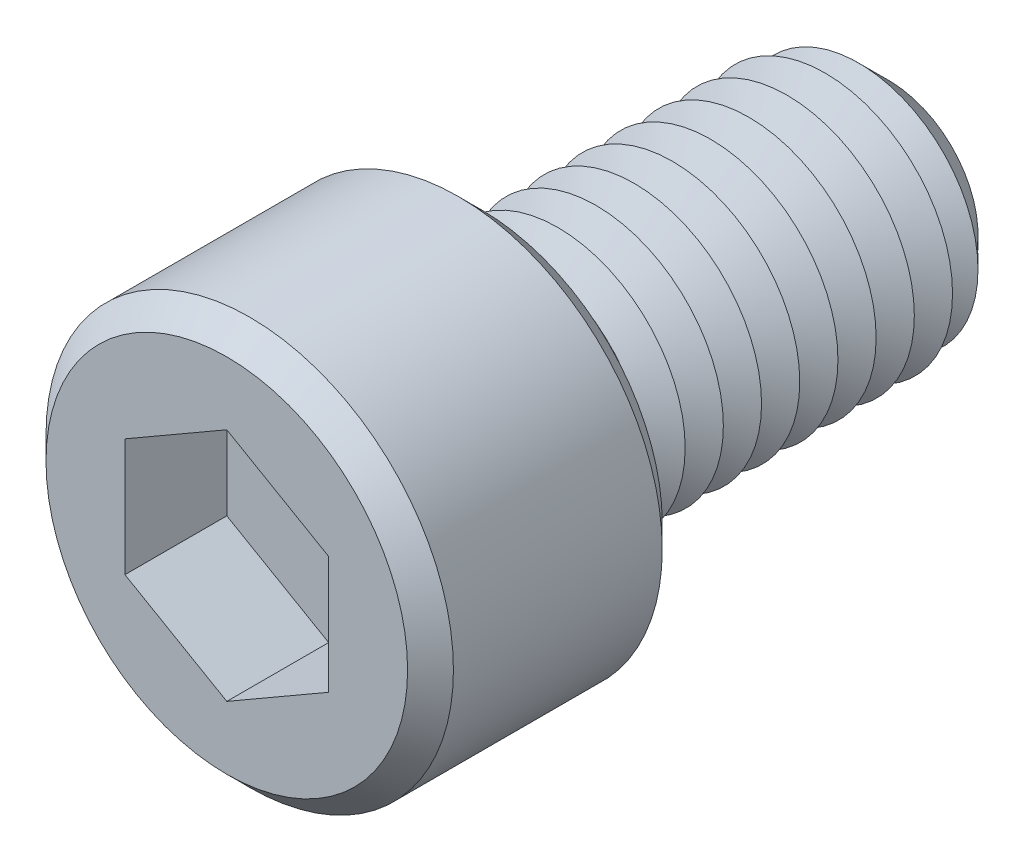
ISO-10303-21;
HEADER;
FILE_DESCRIPTION(('STEP AP214'),'2;1');
FILE_NAME('part.step','',(''),(''),'','','');
FILE_SCHEMA(('AUTOMOTIVE_DESIGN { 1 0 10303 214 1 1 1 1 }'));
ENDSEC;
DATA;
#1=APPLICATION_CONTEXT('core data for automotive mechanical design processes');
#2=APPLICATION_PROTOCOL_DEFINITION('international standard','automotive_design',2000,#1);
#3=PRODUCT_CONTEXT('',#1,'mechanical');
#4=PRODUCT('Part','Part','',(#3));
#5=PRODUCT_RELATED_PRODUCT_CATEGORY('part','',(#4));
#6=PRODUCT_DEFINITION_FORMATION('','',#4);
#7=PRODUCT_DEFINITION_CONTEXT('part definition',#1,'design');
#8=PRODUCT_DEFINITION('design','',#6,#7);
#9=PRODUCT_DEFINITION_SHAPE('','',#8);
#10=(LENGTH_UNIT() NAMED_UNIT(*) SI_UNIT(.MILLI.,.METRE.));
#11=(NAMED_UNIT(*) PLANE_ANGLE_UNIT() SI_UNIT($,.RADIAN.));
#12=(NAMED_UNIT(*) SI_UNIT($,.STERADIAN.) SOLID_ANGLE_UNIT());
#13=UNCERTAINTY_MEASURE_WITH_UNIT(LENGTH_MEASURE(1.E-05),#10,'distance_accuracy_value','');
#14=(GEOMETRIC_REPRESENTATION_CONTEXT(3) GLOBAL_UNCERTAINTY_ASSIGNED_CONTEXT((#13)) GLOBAL_UNIT_ASSIGNED_CONTEXT((#10,
#11,#12)) REPRESENTATION_CONTEXT('',''));
#15=CARTESIAN_POINT('',(0.,0.,0.));
#16=DIRECTION('',(0.,0.,1.));
#17=DIRECTION('',(1.,0.,0.));
#18=AXIS2_PLACEMENT_3D('',#15,#16,#17);
#19=CARTESIAN_POINT('',(0.,0.,10.));
#20=DIRECTION('',(0.,0.,-1.));
#21=DIRECTION('',(-1.,0.,0.));
#22=AXIS2_PLACEMENT_3D('',#19,#20,#21);
#23=CYLINDRICAL_SURFACE('',#22,8.);
#24=CARTESIAN_POINT('',(0.,0.,0.899999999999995));
#25=DIRECTION('',(0.,0.,1.));
#26=DIRECTION('',(1.,0.,0.));
#27=AXIS2_PLACEMENT_3D('',#24,#25,#26);
#28=CIRCLE('',#27,8.);
#29=CARTESIAN_POINT('',(8.,0.,0.899999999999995));
#30=VERTEX_POINT('',#29);
#31=EDGE_CURVE('E257',#30,#30,#28,.T.);
#32=ORIENTED_EDGE('',*,*,#31,.T.);
#33=EDGE_LOOP('',(#32));
#34=FACE_BOUND('',#33,.T.);
#35=CARTESIAN_POINT('',(0.,0.,9.1));
#36=DIRECTION('',(0.,0.,1.));
#37=DIRECTION('',(1.,0.,0.));
#38=AXIS2_PLACEMENT_3D('',#35,#36,#37);
#39=CIRCLE('',#38,8.);
#40=CARTESIAN_POINT('',(8.,0.,9.1));
#41=VERTEX_POINT('',#40);
#42=EDGE_CURVE('E250',#41,#41,#39,.F.);
#43=ORIENTED_EDGE('',*,*,#42,.T.);
#44=EDGE_LOOP('',(#43));
#45=FACE_BOUND('',#44,.T.);
#46=ADVANCED_FACE('F39',(#34,#45),#23,.T.);
#47=CARTESIAN_POINT('',(0.,0.,10.));
#48=DIRECTION('',(0.,0.,1.));
#49=DIRECTION('',(1.,0.,0.));
#50=AXIS2_PLACEMENT_3D('',#47,#48,#49);
#51=PLANE('',#50);
#52=CARTESIAN_POINT('',(0.,0.,10.));
#53=DIRECTION('',(0.,0.,1.));
#54=DIRECTION('',(1.,0.,0.));
#55=AXIS2_PLACEMENT_3D('',#52,#53,#54);
#56=CIRCLE('',#55,7.1);
#57=CARTESIAN_POINT('',(7.1,0.,10.));
#58=VERTEX_POINT('',#57);
#59=EDGE_CURVE('E11',#58,#58,#56,.T.);
#60=ORIENTED_EDGE('',*,*,#59,.T.);
#61=EDGE_LOOP('',(#60));
#62=FACE_BOUND('',#61,.T.);
#63=DIRECTION('',(-0.866025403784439,0.5,0.));
#64=VECTOR('',#63,1.);
#65=CARTESIAN_POINT('',(4.,2.3094010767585,10.));
#66=LINE('',#65,#64);
#67=CARTESIAN_POINT('',(4.,2.3094010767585,10.));
#68=VERTEX_POINT('',#67);
#69=CARTESIAN_POINT('',(0.,4.61880215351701,10.));
#70=VERTEX_POINT('',#69);
#71=EDGE_CURVE('E55',#68,#70,#66,.T.);
#72=ORIENTED_EDGE('',*,*,#71,.F.);
#73=DIRECTION('',(0.,1.,0.));
#74=VECTOR('',#73,1.);
#75=CARTESIAN_POINT('',(4.,-2.3094010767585,10.));
#76=LINE('',#75,#74);
#77=CARTESIAN_POINT('',(4.,-2.3094010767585,10.));
#78=VERTEX_POINT('',#77);
#79=EDGE_CURVE('E151',#78,#68,#76,.T.);
#80=ORIENTED_EDGE('',*,*,#79,.F.);
#81=DIRECTION('',(0.866025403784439,0.5,0.));
#82=VECTOR('',#81,1.);
#83=CARTESIAN_POINT('',(0.,-4.618802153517,10.));
#84=LINE('',#83,#82);
#85=CARTESIAN_POINT('',(0.,-4.618802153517,10.));
#86=VERTEX_POINT('',#85);
#87=EDGE_CURVE('E148',#86,#78,#84,.T.);
#88=ORIENTED_EDGE('',*,*,#87,.F.);
#89=DIRECTION('',(0.866025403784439,-0.5,0.));
#90=VECTOR('',#89,1.);
#91=CARTESIAN_POINT('',(-4.,-2.3094010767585,10.));
#92=LINE('',#91,#90);
#93=CARTESIAN_POINT('',(-4.,-2.3094010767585,10.));
#94=VERTEX_POINT('',#93);
#95=EDGE_CURVE('E103',#94,#86,#92,.T.);
#96=ORIENTED_EDGE('',*,*,#95,.F.);
#97=DIRECTION('',(0.,-1.,0.));
#98=VECTOR('',#97,1.);
#99=CARTESIAN_POINT('',(-4.,2.3094010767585,10.));
#100=LINE('',#99,#98);
#101=CARTESIAN_POINT('',(-4.,2.3094010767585,10.));
#102=VERTEX_POINT('',#101);
#103=EDGE_CURVE('E142',#102,#94,#100,.T.);
#104=ORIENTED_EDGE('',*,*,#103,.F.);
#105=DIRECTION('',(-0.866025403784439,-0.5,0.));
#106=VECTOR('',#105,1.);
#107=CARTESIAN_POINT('',(0.,4.61880215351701,10.));
#108=LINE('',#107,#106);
#109=EDGE_CURVE('E137',#70,#102,#108,.T.);
#110=ORIENTED_EDGE('',*,*,#109,.F.);
#111=EDGE_LOOP('',(#72,#80,#88,#96,#104,#110));
#112=FACE_BOUND('',#111,.T.);
#113=ADVANCED_FACE('F275',(#62,#112),#51,.T.);
#114=CARTESIAN_POINT('',(0.,0.,0.));
#115=DIRECTION('',(0.,0.,1.));
#116=DIRECTION('',(1.,0.,0.));
#117=AXIS2_PLACEMENT_3D('',#114,#115,#116);
#118=PLANE('',#117);
#119=CARTESIAN_POINT('',(0.,0.,0.));
#120=DIRECTION('',(0.,0.,1.));
#121=DIRECTION('',(1.,0.,0.));
#122=AXIS2_PLACEMENT_3D('',#119,#120,#121);
#123=CIRCLE('',#122,7.1);
#124=CARTESIAN_POINT('',(7.1,0.,0.));
#125=VERTEX_POINT('',#124);
#126=EDGE_CURVE('E48',#125,#125,#123,.F.);
#127=ORIENTED_EDGE('',*,*,#126,.T.);
#128=EDGE_LOOP('',(#127));
#129=FACE_BOUND('',#128,.T.);
#130=CARTESIAN_POINT('',(0.,0.,0.));
#131=DIRECTION('',(0.,0.,1.));
#132=DIRECTION('',(1.,0.,0.));
#133=AXIS2_PLACEMENT_3D('',#130,#131,#132);
#134=CIRCLE('',#133,5.);
#135=CARTESIAN_POINT('',(5.,0.,0.));
#136=VERTEX_POINT('',#135);
#137=EDGE_CURVE('E243',#136,#136,#134,.T.);
#138=ORIENTED_EDGE('',*,*,#137,.T.);
#139=EDGE_LOOP('',(#138));
#140=FACE_BOUND('',#139,.T.);
#141=ADVANCED_FACE('F264',(#129,#140),#118,.F.);
#142=CARTESIAN_POINT('',(0.,0.,0.));
#143=DIRECTION('',(0.,0.,1.));
#144=DIRECTION('',(1.,0.,0.));
#145=AXIS2_PLACEMENT_3D('',#142,#143,#144);
#146=CONICAL_SURFACE('',#145,5.,1.0471975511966);
#147=CARTESIAN_POINT('',(0.,0.,-0.749999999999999));
#148=DIRECTION('',(0.,0.,1.));
#149=DIRECTION('',(1.,0.,0.));
#150=AXIS2_PLACEMENT_3D('',#147,#148,#149);
#151=CIRCLE('',#150,3.70096189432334);
#152=CARTESIAN_POINT('',(3.70096189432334,0.,-0.749999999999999));
#153=VERTEX_POINT('',#152);
#154=EDGE_CURVE('E239',#153,#153,#151,.T.);
#155=ORIENTED_EDGE('',*,*,#154,.T.);
#156=EDGE_LOOP('',(#155));
#157=FACE_BOUND('',#156,.T.);
#158=ORIENTED_EDGE('',*,*,#137,.F.);
#159=EDGE_LOOP('',(#158));
#160=FACE_BOUND('',#159,.T.);
#161=ADVANCED_FACE('F404',(#157,#160),#146,.T.);
#162=CARTESIAN_POINT('',(0.,0.,-0.749999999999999));
#163=DIRECTION('',(0.,0.,-1.));
#164=DIRECTION('',(-1.,0.,0.));
#165=AXIS2_PLACEMENT_3D('',#162,#163,#164);
#166=CONICAL_SURFACE('',#165,3.70096189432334,1.0471975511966);
#167=CARTESIAN_POINT('',(0.,0.,-1.5));
#168=DIRECTION('',(0.,0.,1.));
#169=DIRECTION('',(1.,0.,0.));
#170=AXIS2_PLACEMENT_3D('',#167,#168,#169);
#171=CIRCLE('',#170,5.);
#172=CARTESIAN_POINT('',(5.,0.,-1.5));
#173=VERTEX_POINT('',#172);
#174=EDGE_CURVE('E235',#173,#173,#171,.T.);
#175=ORIENTED_EDGE('',*,*,#174,.T.);
#176=EDGE_LOOP('',(#175));
#177=FACE_BOUND('',#176,.T.);
#178=ORIENTED_EDGE('',*,*,#154,.F.);
#179=EDGE_LOOP('',(#178));
#180=FACE_BOUND('',#179,.T.);
#181=ADVANCED_FACE('F400',(#177,#180),#166,.T.);
#182=CARTESIAN_POINT('',(0.,0.,-1.5));
#183=DIRECTION('',(0.,0.,1.));
#184=DIRECTION('',(1.,0.,0.));
#185=AXIS2_PLACEMENT_3D('',#182,#183,#184);
#186=CONICAL_SURFACE('',#185,5.,1.0471975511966);
#187=CARTESIAN_POINT('',(0.,0.,-2.25));
#188=DIRECTION('',(0.,0.,1.));
#189=DIRECTION('',(1.,0.,0.));
#190=AXIS2_PLACEMENT_3D('',#187,#188,#189);
#191=CIRCLE('',#190,3.70096189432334);
#192=CARTESIAN_POINT('',(3.70096189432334,0.,-2.25));
#193=VERTEX_POINT('',#192);
#194=EDGE_CURVE('E231',#193,#193,#191,.T.);
#195=ORIENTED_EDGE('',*,*,#194,.T.);
#196=EDGE_LOOP('',(#195));
#197=FACE_BOUND('',#196,.T.);
#198=ORIENTED_EDGE('',*,*,#174,.F.);
#199=EDGE_LOOP('',(#198));
#200=FACE_BOUND('',#199,.T.);
#201=ADVANCED_FACE('F396',(#197,#200),#186,.T.);
#202=CARTESIAN_POINT('',(0.,0.,-2.25));
#203=DIRECTION('',(0.,0.,-1.));
#204=DIRECTION('',(-1.,0.,0.));
#205=AXIS2_PLACEMENT_3D('',#202,#203,#204);
#206=CONICAL_SURFACE('',#205,3.70096189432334,1.0471975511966);
#207=CARTESIAN_POINT('',(0.,0.,-3.));
#208=DIRECTION('',(0.,0.,1.));
#209=DIRECTION('',(1.,0.,0.));
#210=AXIS2_PLACEMENT_3D('',#207,#208,#209);
#211=CIRCLE('',#210,5.);
#212=CARTESIAN_POINT('',(5.,0.,-3.));
#213=VERTEX_POINT('',#212);
#214=EDGE_CURVE('E227',#213,#213,#211,.T.);
#215=ORIENTED_EDGE('',*,*,#214,.T.);
#216=EDGE_LOOP('',(#215));
#217=FACE_BOUND('',#216,.T.);
#218=ORIENTED_EDGE('',*,*,#194,.F.);
#219=EDGE_LOOP('',(#218));
#220=FACE_BOUND('',#219,.T.);
#221=ADVANCED_FACE('F392',(#217,#220),#206,.T.);
#222=CARTESIAN_POINT('',(0.,0.,-3.));
#223=DIRECTION('',(0.,0.,1.));
#224=DIRECTION('',(1.,0.,0.));
#225=AXIS2_PLACEMENT_3D('',#222,#223,#224);
#226=CONICAL_SURFACE('',#225,5.,1.0471975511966);
#227=CARTESIAN_POINT('',(0.,0.,-3.75));
#228=DIRECTION('',(0.,0.,1.));
#229=DIRECTION('',(1.,0.,0.));
#230=AXIS2_PLACEMENT_3D('',#227,#228,#229);
#231=CIRCLE('',#230,3.70096189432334);
#232=CARTESIAN_POINT('',(3.70096189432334,0.,-3.75));
#233=VERTEX_POINT('',#232);
#234=EDGE_CURVE('E223',#233,#233,#231,.T.);
#235=ORIENTED_EDGE('',*,*,#234,.T.);
#236=EDGE_LOOP('',(#235));
#237=FACE_BOUND('',#236,.T.);
#238=ORIENTED_EDGE('',*,*,#214,.F.);
#239=EDGE_LOOP('',(#238));
#240=FACE_BOUND('',#239,.T.);
#241=ADVANCED_FACE('F388',(#237,#240),#226,.T.);
#242=CARTESIAN_POINT('',(0.,0.,-3.75));
#243=DIRECTION('',(0.,0.,-1.));
#244=DIRECTION('',(-1.,0.,0.));
#245=AXIS2_PLACEMENT_3D('',#242,#243,#244);
#246=CONICAL_SURFACE('',#245,3.70096189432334,1.0471975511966);
#247=CARTESIAN_POINT('',(0.,0.,-4.5));
#248=DIRECTION('',(0.,0.,1.));
#249=DIRECTION('',(1.,0.,0.));
#250=AXIS2_PLACEMENT_3D('',#247,#248,#249);
#251=CIRCLE('',#250,5.);
#252=CARTESIAN_POINT('',(5.,0.,-4.5));
#253=VERTEX_POINT('',#252);
#254=EDGE_CURVE('E219',#253,#253,#251,.T.);
#255=ORIENTED_EDGE('',*,*,#254,.T.);
#256=EDGE_LOOP('',(#255));
#257=FACE_BOUND('',#256,.T.);
#258=ORIENTED_EDGE('',*,*,#234,.F.);
#259=EDGE_LOOP('',(#258));
#260=FACE_BOUND('',#259,.T.);
#261=ADVANCED_FACE('F384',(#257,#260),#246,.T.);
#262=CARTESIAN_POINT('',(0.,0.,-4.5));
#263=DIRECTION('',(0.,0.,1.));
#264=DIRECTION('',(1.,0.,0.));
#265=AXIS2_PLACEMENT_3D('',#262,#263,#264);
#266=CONICAL_SURFACE('',#265,5.,1.0471975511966);
#267=CARTESIAN_POINT('',(0.,0.,-5.25));
#268=DIRECTION('',(0.,0.,1.));
#269=DIRECTION('',(1.,0.,0.));
#270=AXIS2_PLACEMENT_3D('',#267,#268,#269);
#271=CIRCLE('',#270,3.70096189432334);
#272=CARTESIAN_POINT('',(3.70096189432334,0.,-5.25));
#273=VERTEX_POINT('',#272);
#274=EDGE_CURVE('E215',#273,#273,#271,.T.);
#275=ORIENTED_EDGE('',*,*,#274,.T.);
#276=EDGE_LOOP('',(#275));
#277=FACE_BOUND('',#276,.T.);
#278=ORIENTED_EDGE('',*,*,#254,.F.);
#279=EDGE_LOOP('',(#278));
#280=FACE_BOUND('',#279,.T.);
#281=ADVANCED_FACE('F380',(#277,#280),#266,.T.);
#282=CARTESIAN_POINT('',(0.,0.,-5.25));
#283=DIRECTION('',(0.,0.,-1.));
#284=DIRECTION('',(-1.,0.,0.));
#285=AXIS2_PLACEMENT_3D('',#282,#283,#284);
#286=CONICAL_SURFACE('',#285,3.70096189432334,1.0471975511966);
#287=CARTESIAN_POINT('',(0.,0.,-6.));
#288=DIRECTION('',(0.,0.,1.));
#289=DIRECTION('',(1.,0.,0.));
#290=AXIS2_PLACEMENT_3D('',#287,#288,#289);
#291=CIRCLE('',#290,5.);
#292=CARTESIAN_POINT('',(5.,0.,-6.));
#293=VERTEX_POINT('',#292);
#294=EDGE_CURVE('E211',#293,#293,#291,.T.);
#295=ORIENTED_EDGE('',*,*,#294,.T.);
#296=EDGE_LOOP('',(#295));
#297=FACE_BOUND('',#296,.T.);
#298=ORIENTED_EDGE('',*,*,#274,.F.);
#299=EDGE_LOOP('',(#298));
#300=FACE_BOUND('',#299,.T.);
#301=ADVANCED_FACE('F376',(#297,#300),#286,.T.);
#302=CARTESIAN_POINT('',(0.,0.,-6.));
#303=DIRECTION('',(0.,0.,1.));
#304=DIRECTION('',(1.,0.,0.));
#305=AXIS2_PLACEMENT_3D('',#302,#303,#304);
#306=CONICAL_SURFACE('',#305,5.,1.0471975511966);
#307=CARTESIAN_POINT('',(0.,0.,-6.75));
#308=DIRECTION('',(0.,0.,1.));
#309=DIRECTION('',(1.,0.,0.));
#310=AXIS2_PLACEMENT_3D('',#307,#308,#309);
#311=CIRCLE('',#310,3.70096189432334);
#312=CARTESIAN_POINT('',(3.70096189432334,0.,-6.75));
#313=VERTEX_POINT('',#312);
#314=EDGE_CURVE('E207',#313,#313,#311,.T.);
#315=ORIENTED_EDGE('',*,*,#314,.T.);
#316=EDGE_LOOP('',(#315));
#317=FACE_BOUND('',#316,.T.);
#318=ORIENTED_EDGE('',*,*,#294,.F.);
#319=EDGE_LOOP('',(#318));
#320=FACE_BOUND('',#319,.T.);
#321=ADVANCED_FACE('F372',(#317,#320),#306,.T.);
#322=CARTESIAN_POINT('',(0.,0.,-6.75));
#323=DIRECTION('',(0.,0.,-1.));
#324=DIRECTION('',(-1.,0.,0.));
#325=AXIS2_PLACEMENT_3D('',#322,#323,#324);
#326=CONICAL_SURFACE('',#325,3.70096189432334,1.0471975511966);
#327=CARTESIAN_POINT('',(0.,0.,-7.5));
#328=DIRECTION('',(0.,0.,1.));
#329=DIRECTION('',(1.,0.,0.));
#330=AXIS2_PLACEMENT_3D('',#327,#328,#329);
#331=CIRCLE('',#330,5.);
#332=CARTESIAN_POINT('',(5.,0.,-7.5));
#333=VERTEX_POINT('',#332);
#334=EDGE_CURVE('E203',#333,#333,#331,.T.);
#335=ORIENTED_EDGE('',*,*,#334,.T.);
#336=EDGE_LOOP('',(#335));
#337=FACE_BOUND('',#336,.T.);
#338=ORIENTED_EDGE('',*,*,#314,.F.);
#339=EDGE_LOOP('',(#338));
#340=FACE_BOUND('',#339,.T.);
#341=ADVANCED_FACE('F368',(#337,#340),#326,.T.);
#342=CARTESIAN_POINT('',(0.,0.,-7.5));
#343=DIRECTION('',(0.,0.,1.));
#344=DIRECTION('',(1.,0.,0.));
#345=AXIS2_PLACEMENT_3D('',#342,#343,#344);
#346=CONICAL_SURFACE('',#345,5.,1.0471975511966);
#347=CARTESIAN_POINT('',(0.,0.,-8.25));
#348=DIRECTION('',(0.,0.,1.));
#349=DIRECTION('',(1.,0.,0.));
#350=AXIS2_PLACEMENT_3D('',#347,#348,#349);
#351=CIRCLE('',#350,3.70096189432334);
#352=CARTESIAN_POINT('',(3.70096189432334,0.,-8.25));
#353=VERTEX_POINT('',#352);
#354=EDGE_CURVE('E199',#353,#353,#351,.T.);
#355=ORIENTED_EDGE('',*,*,#354,.T.);
#356=EDGE_LOOP('',(#355));
#357=FACE_BOUND('',#356,.T.);
#358=ORIENTED_EDGE('',*,*,#334,.F.);
#359=EDGE_LOOP('',(#358));
#360=FACE_BOUND('',#359,.T.);
#361=ADVANCED_FACE('F364',(#357,#360),#346,.T.);
#362=CARTESIAN_POINT('',(0.,0.,-8.25));
#363=DIRECTION('',(0.,0.,-1.));
#364=DIRECTION('',(-1.,0.,0.));
#365=AXIS2_PLACEMENT_3D('',#362,#363,#364);
#366=CONICAL_SURFACE('',#365,3.70096189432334,1.0471975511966);
#367=CARTESIAN_POINT('',(0.,0.,-9.));
#368=DIRECTION('',(0.,0.,1.));
#369=DIRECTION('',(1.,0.,0.));
#370=AXIS2_PLACEMENT_3D('',#367,#368,#369);
#371=CIRCLE('',#370,5.);
#372=CARTESIAN_POINT('',(5.,0.,-9.));
#373=VERTEX_POINT('',#372);
#374=EDGE_CURVE('E195',#373,#373,#371,.T.);
#375=ORIENTED_EDGE('',*,*,#374,.T.);
#376=EDGE_LOOP('',(#375));
#377=FACE_BOUND('',#376,.T.);
#378=ORIENTED_EDGE('',*,*,#354,.F.);
#379=EDGE_LOOP('',(#378));
#380=FACE_BOUND('',#379,.T.);
#381=ADVANCED_FACE('F360',(#377,#380),#366,.T.);
#382=CARTESIAN_POINT('',(0.,0.,-9.));
#383=DIRECTION('',(0.,0.,1.));
#384=DIRECTION('',(1.,0.,0.));
#385=AXIS2_PLACEMENT_3D('',#382,#383,#384);
#386=CONICAL_SURFACE('',#385,5.,1.0471975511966);
#387=CARTESIAN_POINT('',(0.,0.,-9.75));
#388=DIRECTION('',(0.,0.,1.));
#389=DIRECTION('',(1.,0.,0.));
#390=AXIS2_PLACEMENT_3D('',#387,#388,#389);
#391=CIRCLE('',#390,3.70096189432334);
#392=CARTESIAN_POINT('',(3.70096189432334,0.,-9.75));
#393=VERTEX_POINT('',#392);
#394=EDGE_CURVE('E191',#393,#393,#391,.T.);
#395=ORIENTED_EDGE('',*,*,#394,.T.);
#396=EDGE_LOOP('',(#395));
#397=FACE_BOUND('',#396,.T.);
#398=ORIENTED_EDGE('',*,*,#374,.F.);
#399=EDGE_LOOP('',(#398));
#400=FACE_BOUND('',#399,.T.);
#401=ADVANCED_FACE('F356',(#397,#400),#386,.T.);
#402=CARTESIAN_POINT('',(0.,0.,-9.75));
#403=DIRECTION('',(0.,0.,-1.));
#404=DIRECTION('',(-1.,0.,0.));
#405=AXIS2_PLACEMENT_3D('',#402,#403,#404);
#406=CONICAL_SURFACE('',#405,3.70096189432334,1.0471975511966);
#407=CARTESIAN_POINT('',(0.,0.,-10.5));
#408=DIRECTION('',(0.,0.,1.));
#409=DIRECTION('',(1.,0.,0.));
#410=AXIS2_PLACEMENT_3D('',#407,#408,#409);
#411=CIRCLE('',#410,5.);
#412=CARTESIAN_POINT('',(5.,0.,-10.5));
#413=VERTEX_POINT('',#412);
#414=EDGE_CURVE('E187',#413,#413,#411,.T.);
#415=ORIENTED_EDGE('',*,*,#414,.T.);
#416=EDGE_LOOP('',(#415));
#417=FACE_BOUND('',#416,.T.);
#418=ORIENTED_EDGE('',*,*,#394,.F.);
#419=EDGE_LOOP('',(#418));
#420=FACE_BOUND('',#419,.T.);
#421=ADVANCED_FACE('F352',(#417,#420),#406,.T.);
#422=CARTESIAN_POINT('',(0.,0.,-10.5));
#423=DIRECTION('',(0.,0.,1.));
#424=DIRECTION('',(1.,0.,0.));
#425=AXIS2_PLACEMENT_3D('',#422,#423,#424);
#426=CONICAL_SURFACE('',#425,5.,1.0471975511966);
#427=CARTESIAN_POINT('',(0.,0.,-11.25));
#428=DIRECTION('',(0.,0.,1.));
#429=DIRECTION('',(1.,0.,0.));
#430=AXIS2_PLACEMENT_3D('',#427,#428,#429);
#431=CIRCLE('',#430,3.70096189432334);
#432=CARTESIAN_POINT('',(3.70096189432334,0.,-11.25));
#433=VERTEX_POINT('',#432);
#434=EDGE_CURVE('E183',#433,#433,#431,.T.);
#435=ORIENTED_EDGE('',*,*,#434,.T.);
#436=EDGE_LOOP('',(#435));
#437=FACE_BOUND('',#436,.T.);
#438=ORIENTED_EDGE('',*,*,#414,.F.);
#439=EDGE_LOOP('',(#438));
#440=FACE_BOUND('',#439,.T.);
#441=ADVANCED_FACE('F348',(#437,#440),#426,.T.);
#442=CARTESIAN_POINT('',(0.,0.,-11.25));
#443=DIRECTION('',(0.,0.,-1.));
#444=DIRECTION('',(-1.,0.,0.));
#445=AXIS2_PLACEMENT_3D('',#442,#443,#444);
#446=CONICAL_SURFACE('',#445,3.70096189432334,1.0471975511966);
#447=CARTESIAN_POINT('',(0.,0.,-12.));
#448=DIRECTION('',(0.,0.,1.));
#449=DIRECTION('',(1.,0.,0.));
#450=AXIS2_PLACEMENT_3D('',#447,#448,#449);
#451=CIRCLE('',#450,5.);
#452=CARTESIAN_POINT('',(5.,0.,-12.));
#453=VERTEX_POINT('',#452);
#454=EDGE_CURVE('E179',#453,#453,#451,.T.);
#455=ORIENTED_EDGE('',*,*,#454,.T.);
#456=EDGE_LOOP('',(#455));
#457=FACE_BOUND('',#456,.T.);
#458=ORIENTED_EDGE('',*,*,#434,.F.);
#459=EDGE_LOOP('',(#458));
#460=FACE_BOUND('',#459,.T.);
#461=ADVANCED_FACE('F344',(#457,#460),#446,.T.);
#462=CARTESIAN_POINT('',(0.,0.,-12.));
#463=DIRECTION('',(0.,0.,1.));
#464=DIRECTION('',(1.,0.,0.));
#465=AXIS2_PLACEMENT_3D('',#462,#463,#464);
#466=CONICAL_SURFACE('',#465,5.,1.0471975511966);
#467=CARTESIAN_POINT('',(0.,0.,-12.75));
#468=DIRECTION('',(0.,0.,1.));
#469=DIRECTION('',(1.,0.,0.));
#470=AXIS2_PLACEMENT_3D('',#467,#468,#469);
#471=CIRCLE('',#470,3.70096189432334);
#472=CARTESIAN_POINT('',(3.70096189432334,0.,-12.75));
#473=VERTEX_POINT('',#472);
#474=EDGE_CURVE('E175',#473,#473,#471,.T.);
#475=ORIENTED_EDGE('',*,*,#474,.T.);
#476=EDGE_LOOP('',(#475));
#477=FACE_BOUND('',#476,.T.);
#478=ORIENTED_EDGE('',*,*,#454,.F.);
#479=EDGE_LOOP('',(#478));
#480=FACE_BOUND('',#479,.T.);
#481=ADVANCED_FACE('F340',(#477,#480),#466,.T.);
#482=CARTESIAN_POINT('',(0.,0.,-12.75));
#483=DIRECTION('',(0.,0.,-1.));
#484=DIRECTION('',(-1.,0.,0.));
#485=AXIS2_PLACEMENT_3D('',#482,#483,#484);
#486=CONICAL_SURFACE('',#485,3.70096189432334,1.0471975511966);
#487=CARTESIAN_POINT('',(0.,0.,-13.5));
#488=DIRECTION('',(0.,0.,1.));
#489=DIRECTION('',(1.,0.,0.));
#490=AXIS2_PLACEMENT_3D('',#487,#488,#489);
#491=CIRCLE('',#490,5.);
#492=CARTESIAN_POINT('',(5.,0.,-13.5));
#493=VERTEX_POINT('',#492);
#494=EDGE_CURVE('E170',#493,#493,#491,.T.);
#495=ORIENTED_EDGE('',*,*,#494,.T.);
#496=EDGE_LOOP('',(#495));
#497=FACE_BOUND('',#496,.T.);
#498=ORIENTED_EDGE('',*,*,#474,.F.);
#499=EDGE_LOOP('',(#498));
#500=FACE_BOUND('',#499,.T.);
#501=ADVANCED_FACE('F336',(#497,#500),#486,.T.);
#502=CARTESIAN_POINT('',(0.,0.,-13.5));
#503=DIRECTION('',(0.,0.,1.));
#504=DIRECTION('',(1.,0.,0.));
#505=AXIS2_PLACEMENT_3D('',#502,#503,#504);
#506=CONICAL_SURFACE('',#505,5.,1.0471975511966);
#507=CARTESIAN_POINT('',(0.,0.,-14.25));
#508=DIRECTION('',(0.,0.,1.));
#509=DIRECTION('',(1.,0.,0.));
#510=AXIS2_PLACEMENT_3D('',#507,#508,#509);
#511=CIRCLE('',#510,3.70096189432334);
#512=CARTESIAN_POINT('',(3.70096189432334,0.,-14.25));
#513=VERTEX_POINT('',#512);
#514=EDGE_CURVE('E157',#513,#513,#511,.T.);
#515=ORIENTED_EDGE('',*,*,#514,.T.);
#516=EDGE_LOOP('',(#515));
#517=FACE_BOUND('',#516,.T.);
#518=ORIENTED_EDGE('',*,*,#494,.F.);
#519=EDGE_LOOP('',(#518));
#520=FACE_BOUND('',#519,.T.);
#521=ADVANCED_FACE('F332',(#517,#520),#506,.T.);
#522=CARTESIAN_POINT('',(0.,0.,-14.25));
#523=DIRECTION('',(0.,0.,-1.));
#524=DIRECTION('',(-1.,0.,0.));
#525=AXIS2_PLACEMENT_3D('',#522,#523,#524);
#526=CONICAL_SURFACE('',#525,3.70096189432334,1.0471975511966);
#527=CARTESIAN_POINT('',(0.,0.,-14.8169872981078));
#528=DIRECTION('',(0.,0.,-1.));
#529=DIRECTION('',(-1.,0.,0.));
#530=AXIS2_PLACEMENT_3D('',#527,#528,#529);
#531=CIRCLE('',#530,4.68301270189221);
#532=CARTESIAN_POINT('',(-4.68301270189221,0.,-14.8169872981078));
#533=VERTEX_POINT('',#532);
#534=EDGE_CURVE('E174',#533,#533,#531,.T.);
#535=ORIENTED_EDGE('',*,*,#534,.F.);
#536=EDGE_LOOP('',(#535));
#537=FACE_BOUND('',#536,.T.);
#538=ORIENTED_EDGE('',*,*,#514,.F.);
#539=EDGE_LOOP('',(#538));
#540=FACE_BOUND('',#539,.T.);
#541=ADVANCED_FACE('F328',(#537,#540),#526,.T.);
#542=CARTESIAN_POINT('',(0.,0.,-16.));
#543=DIRECTION('',(0.,0.,-1.));
#544=DIRECTION('',(-1.,0.,0.));
#545=AXIS2_PLACEMENT_3D('',#542,#543,#544);
#546=PLANE('',#545);
#547=CARTESIAN_POINT('',(0.,0.,-16.));
#548=DIRECTION('',(0.,0.,-1.));
#549=DIRECTION('',(-1.,0.,0.));
#550=AXIS2_PLACEMENT_3D('',#547,#548,#549);
#551=CIRCLE('',#550,0.9);
#552=CARTESIAN_POINT('',(-0.9,0.,-16.));
#553=VERTEX_POINT('',#552);
#554=EDGE_CURVE('E138',#553,#553,#551,.F.);
#555=ORIENTED_EDGE('',*,*,#554,.T.);
#556=EDGE_LOOP('',(#555));
#557=FACE_BOUND('',#556,.T.);
#558=CARTESIAN_POINT('',(0.,0.,-16.));
#559=DIRECTION('',(0.,0.,-1.));
#560=DIRECTION('',(-1.,0.,0.));
#561=AXIS2_PLACEMENT_3D('',#558,#559,#560);
#562=CIRCLE('',#561,3.5);
#563=CARTESIAN_POINT('',(-3.5,0.,-16.));
#564=VERTEX_POINT('',#563);
#565=EDGE_CURVE('E247',#564,#564,#562,.T.);
#566=ORIENTED_EDGE('',*,*,#565,.T.);
#567=EDGE_LOOP('',(#566));
#568=FACE_BOUND('',#567,.T.);
#569=ADVANCED_FACE('F331',(#557,#568),#546,.T.);
#570=CARTESIAN_POINT('',(0.,0.,-16.));
#571=DIRECTION('',(0.,0.,1.));
#572=DIRECTION('',(1.,0.,0.));
#573=AXIS2_PLACEMENT_3D('',#570,#571,#572);
#574=CONICAL_SURFACE('',#573,3.5,0.785398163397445);
#575=ORIENTED_EDGE('',*,*,#565,.F.);
#576=EDGE_LOOP('',(#575));
#577=FACE_BOUND('',#576,.T.);
#578=ORIENTED_EDGE('',*,*,#534,.T.);
#579=EDGE_LOOP('',(#578));
#580=FACE_BOUND('',#579,.T.);
#581=ADVANCED_FACE('F327',(#577,#580),#574,.T.);
#582=CARTESIAN_POINT('',(4.,2.3094010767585,6.));
#583=DIRECTION('',(0.5,0.866025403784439,0.));
#584=DIRECTION('',(-0.866025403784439,0.5,0.));
#585=AXIS2_PLACEMENT_3D('',#582,#583,#584);
#586=PLANE('',#585);
#587=ORIENTED_EDGE('',*,*,#71,.T.);
#588=DIRECTION('',(0.,0.,1.));
#589=VECTOR('',#588,1.);
#590=CARTESIAN_POINT('',(0.,4.61880215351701,6.));
#591=LINE('',#590,#589);
#592=CARTESIAN_POINT('',(0.,4.61880215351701,6.));
#593=VERTEX_POINT('',#592);
#594=EDGE_CURVE('E85',#593,#70,#591,.T.);
#595=ORIENTED_EDGE('',*,*,#594,.F.);
#596=DIRECTION('',(-0.866025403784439,0.5,0.));
#597=VECTOR('',#596,1.);
#598=CARTESIAN_POINT('',(4.,2.3094010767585,6.));
#599=LINE('',#598,#597);
#600=CARTESIAN_POINT('',(4.,2.3094010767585,6.));
#601=VERTEX_POINT('',#600);
#602=EDGE_CURVE('E154',#601,#593,#599,.T.);
#603=ORIENTED_EDGE('',*,*,#602,.F.);
#604=DIRECTION('',(0.,0.,1.));
#605=VECTOR('',#604,1.);
#606=CARTESIAN_POINT('',(4.,2.3094010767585,6.));
#607=LINE('',#606,#605);
#608=EDGE_CURVE('E63',#601,#68,#607,.T.);
#609=ORIENTED_EDGE('',*,*,#608,.T.);
#610=EDGE_LOOP('',(#587,#595,#603,#609));
#611=FACE_BOUND('',#610,.T.);
#612=ADVANCED_FACE('F317',(#611),#586,.F.);
#613=CARTESIAN_POINT('',(4.,-2.3094010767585,6.));
#614=DIRECTION('',(1.,0.,0.));
#615=DIRECTION('',(0.,0.,-1.));
#616=AXIS2_PLACEMENT_3D('',#613,#614,#615);
#617=PLANE('',#616);
#618=ORIENTED_EDGE('',*,*,#79,.T.);
#619=ORIENTED_EDGE('',*,*,#608,.F.);
#620=DIRECTION('',(0.,1.,0.));
#621=VECTOR('',#620,1.);
#622=CARTESIAN_POINT('',(4.,-2.3094010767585,6.));
#623=LINE('',#622,#621);
#624=CARTESIAN_POINT('',(4.,-2.3094010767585,6.));
#625=VERTEX_POINT('',#624);
#626=EDGE_CURVE('E117',#625,#601,#623,.T.);
#627=ORIENTED_EDGE('',*,*,#626,.F.);
#628=DIRECTION('',(0.,0.,1.));
#629=VECTOR('',#628,1.);
#630=CARTESIAN_POINT('',(4.,-2.3094010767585,6.));
#631=LINE('',#630,#629);
#632=EDGE_CURVE('E108',#625,#78,#631,.T.);
#633=ORIENTED_EDGE('',*,*,#632,.T.);
#634=EDGE_LOOP('',(#618,#619,#627,#633));
#635=FACE_BOUND('',#634,.T.);
#636=ADVANCED_FACE('F314',(#635),#617,.F.);
#637=CARTESIAN_POINT('',(0.,-4.618802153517,6.));
#638=DIRECTION('',(0.5,-0.866025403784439,0.));
#639=DIRECTION('',(0.866025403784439,0.5,0.));
#640=AXIS2_PLACEMENT_3D('',#637,#638,#639);
#641=PLANE('',#640);
#642=ORIENTED_EDGE('',*,*,#87,.T.);
#643=ORIENTED_EDGE('',*,*,#632,.F.);
#644=DIRECTION('',(0.866025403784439,0.5,0.));
#645=VECTOR('',#644,1.);
#646=CARTESIAN_POINT('',(0.,-4.618802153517,6.));
#647=LINE('',#646,#645);
#648=CARTESIAN_POINT('',(0.,-4.618802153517,6.));
#649=VERTEX_POINT('',#648);
#650=EDGE_CURVE('E112',#649,#625,#647,.T.);
#651=ORIENTED_EDGE('',*,*,#650,.F.);
#652=DIRECTION('',(0.,0.,1.));
#653=VECTOR('',#652,1.);
#654=CARTESIAN_POINT('',(0.,-4.618802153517,6.));
#655=LINE('',#654,#653);
#656=EDGE_CURVE('E96',#649,#86,#655,.T.);
#657=ORIENTED_EDGE('',*,*,#656,.T.);
#658=EDGE_LOOP('',(#642,#643,#651,#657));
#659=FACE_BOUND('',#658,.T.);
#660=ADVANCED_FACE('F113',(#659),#641,.F.);
#661=CARTESIAN_POINT('',(-4.,-2.3094010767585,6.));
#662=DIRECTION('',(-0.5,-0.866025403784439,0.));
#663=DIRECTION('',(0.866025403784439,-0.5,0.));
#664=AXIS2_PLACEMENT_3D('',#661,#662,#663);
#665=PLANE('',#664);
#666=ORIENTED_EDGE('',*,*,#95,.T.);
#667=ORIENTED_EDGE('',*,*,#656,.F.);
#668=DIRECTION('',(0.866025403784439,-0.5,0.));
#669=VECTOR('',#668,1.);
#670=CARTESIAN_POINT('',(-4.,-2.3094010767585,6.));
#671=LINE('',#670,#669);
#672=CARTESIAN_POINT('',(-4.,-2.3094010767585,6.));
#673=VERTEX_POINT('',#672);
#674=EDGE_CURVE('E100',#673,#649,#671,.T.);
#675=ORIENTED_EDGE('',*,*,#674,.F.);
#676=DIRECTION('',(0.,0.,1.));
#677=VECTOR('',#676,1.);
#678=CARTESIAN_POINT('',(-4.,-2.3094010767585,6.));
#679=LINE('',#678,#677);
#680=EDGE_CURVE('E109',#673,#94,#679,.T.);
#681=ORIENTED_EDGE('',*,*,#680,.T.);
#682=EDGE_LOOP('',(#666,#667,#675,#681));
#683=FACE_BOUND('',#682,.T.);
#684=ADVANCED_FACE('F98',(#683),#665,.F.);
#685=CARTESIAN_POINT('',(-4.,2.3094010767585,6.));
#686=DIRECTION('',(-1.,0.,0.));
#687=DIRECTION('',(0.,0.,1.));
#688=AXIS2_PLACEMENT_3D('',#685,#686,#687);
#689=PLANE('',#688);
#690=ORIENTED_EDGE('',*,*,#103,.T.);
#691=ORIENTED_EDGE('',*,*,#680,.F.);
#692=DIRECTION('',(0.,-1.,0.));
#693=VECTOR('',#692,1.);
#694=CARTESIAN_POINT('',(-4.,2.3094010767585,6.));
#695=LINE('',#694,#693);
#696=CARTESIAN_POINT('',(-4.,2.3094010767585,6.));
#697=VERTEX_POINT('',#696);
#698=EDGE_CURVE('E123',#697,#673,#695,.T.);
#699=ORIENTED_EDGE('',*,*,#698,.F.);
#700=DIRECTION('',(0.,0.,1.));
#701=VECTOR('',#700,1.);
#702=CARTESIAN_POINT('',(-4.,2.3094010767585,6.));
#703=LINE('',#702,#701);
#704=EDGE_CURVE('E162',#697,#102,#703,.T.);
#705=ORIENTED_EDGE('',*,*,#704,.T.);
#706=EDGE_LOOP('',(#690,#691,#699,#705));
#707=FACE_BOUND('',#706,.T.);
#708=ADVANCED_FACE('F311',(#707),#689,.F.);
#709=CARTESIAN_POINT('',(0.,4.61880215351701,6.));
#710=DIRECTION('',(-0.5,0.866025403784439,0.));
#711=DIRECTION('',(-0.866025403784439,-0.5,0.));
#712=AXIS2_PLACEMENT_3D('',#709,#710,#711);
#713=PLANE('',#712);
#714=ORIENTED_EDGE('',*,*,#109,.T.);
#715=ORIENTED_EDGE('',*,*,#704,.F.);
#716=DIRECTION('',(-0.866025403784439,-0.5,0.));
#717=VECTOR('',#716,1.);
#718=CARTESIAN_POINT('',(0.,4.61880215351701,6.));
#719=LINE('',#718,#717);
#720=EDGE_CURVE('E129',#593,#697,#719,.T.);
#721=ORIENTED_EDGE('',*,*,#720,.F.);
#722=ORIENTED_EDGE('',*,*,#594,.T.);
#723=EDGE_LOOP('',(#714,#715,#721,#722));
#724=FACE_BOUND('',#723,.T.);
#725=ADVANCED_FACE('F290',(#724),#713,.F.);
#726=CARTESIAN_POINT('',(0.,0.,6.));
#727=DIRECTION('',(0.,0.,1.));
#728=DIRECTION('',(1.,0.,0.));
#729=AXIS2_PLACEMENT_3D('',#726,#727,#728);
#730=PLANE('',#729);
#731=CARTESIAN_POINT('',(0.,0.,6.));
#732=DIRECTION('',(0.,0.,1.));
#733=DIRECTION('',(1.,0.,0.));
#734=AXIS2_PLACEMENT_3D('',#731,#732,#733);
#735=CIRCLE('',#734,0.9);
#736=CARTESIAN_POINT('',(0.9,0.,6.));
#737=VERTEX_POINT('',#736);
#738=EDGE_CURVE('E297',#737,#737,#735,.T.);
#739=ORIENTED_EDGE('',*,*,#738,.F.);
#740=EDGE_LOOP('',(#739));
#741=FACE_BOUND('',#740,.T.);
#742=ORIENTED_EDGE('',*,*,#602,.T.);
#743=ORIENTED_EDGE('',*,*,#720,.T.);
#744=ORIENTED_EDGE('',*,*,#698,.T.);
#745=ORIENTED_EDGE('',*,*,#674,.T.);
#746=ORIENTED_EDGE('',*,*,#650,.T.);
#747=ORIENTED_EDGE('',*,*,#626,.T.);
#748=EDGE_LOOP('',(#742,#743,#744,#745,#746,#747));
#749=FACE_BOUND('',#748,.T.);
#750=ADVANCED_FACE('F120',(#741,#749),#730,.T.);
#751=CARTESIAN_POINT('',(0.,0.,-18.5455844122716));
#752=DIRECTION('',(0.,0.,1.));
#753=DIRECTION('',(1.,0.,0.));
#754=AXIS2_PLACEMENT_3D('',#751,#752,#753);
#755=CYLINDRICAL_SURFACE('',#754,0.9);
#756=ORIENTED_EDGE('',*,*,#738,.T.);
#757=EDGE_LOOP('',(#756));
#758=FACE_BOUND('',#757,.T.);
#759=ORIENTED_EDGE('',*,*,#554,.F.);
#760=EDGE_LOOP('',(#759));
#761=FACE_BOUND('',#760,.T.);
#762=ADVANCED_FACE('F270',(#758,#761),#755,.F.);
#763=CARTESIAN_POINT('',(0.,0.,0.899999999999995));
#764=DIRECTION('',(0.,0.,1.));
#765=DIRECTION('',(1.,0.,0.));
#766=AXIS2_PLACEMENT_3D('',#763,#764,#765);
#767=CONICAL_SURFACE('',#766,8.,0.78539816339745);
#768=ORIENTED_EDGE('',*,*,#126,.F.);
#769=EDGE_LOOP('',(#768));
#770=FACE_BOUND('',#769,.T.);
#771=ORIENTED_EDGE('',*,*,#31,.F.);
#772=EDGE_LOOP('',(#771));
#773=FACE_BOUND('',#772,.T.);
#774=ADVANCED_FACE('F267',(#770,#773),#767,.T.);
#775=CARTESIAN_POINT('',(0.,0.,10.));
#776=DIRECTION('',(0.,0.,-1.));
#777=DIRECTION('',(-1.,0.,0.));
#778=AXIS2_PLACEMENT_3D('',#775,#776,#777);
#779=CONICAL_SURFACE('',#778,7.1,0.785398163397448);
#780=ORIENTED_EDGE('',*,*,#42,.F.);
#781=EDGE_LOOP('',(#780));
#782=FACE_BOUND('',#781,.T.);
#783=ORIENTED_EDGE('',*,*,#59,.F.);
#784=EDGE_LOOP('',(#783));
#785=FACE_BOUND('',#784,.T.);
#786=ADVANCED_FACE('F41',(#782,#785),#779,.T.);
#787=CLOSED_SHELL('',(#46,#113,#141,#161,#181,#201,#221,#241,#261,#281,#301,#321,#341,#361,#381,
#401,#421,#441,#461,#481,#501,#521,#541,#569,#581,#612,#636,#660,#684,#708,#725,#750,#762,#774,#786));
#788=MANIFOLD_SOLID_BREP('B2',#787);
#789=ADVANCED_BREP_SHAPE_REPRESENTATION('',(#18,#788),#14);
#790=SHAPE_DEFINITION_REPRESENTATION(#9,#789);
ENDSEC;
END-ISO-10303-21;
